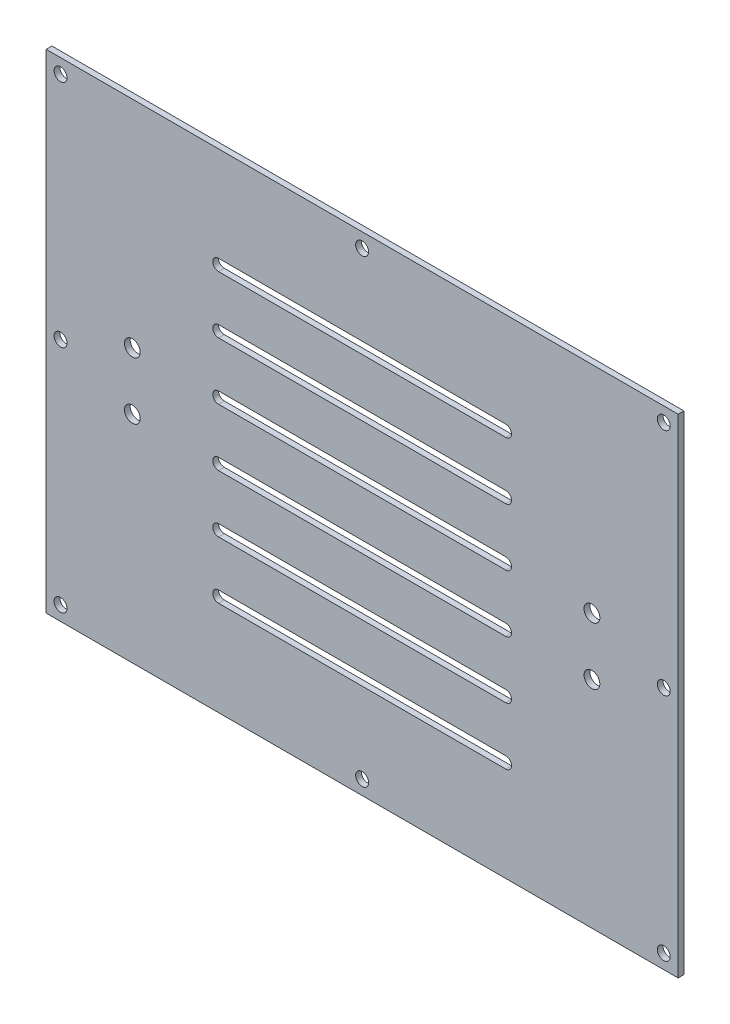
ISO-10303-21;
HEADER;
FILE_DESCRIPTION(('STEP AP214'),'2;1');
FILE_NAME('part.step','',(''),(''),'','','');
FILE_SCHEMA(('AUTOMOTIVE_DESIGN { 1 0 10303 214 1 1 1 1 }'));
ENDSEC;
DATA;
#1=APPLICATION_CONTEXT('core data for automotive mechanical design processes');
#2=APPLICATION_PROTOCOL_DEFINITION('international standard','automotive_design',2000,#1);
#3=PRODUCT_CONTEXT('',#1,'mechanical');
#4=PRODUCT('Part','Part','',(#3));
#5=PRODUCT_RELATED_PRODUCT_CATEGORY('part','',(#4));
#6=PRODUCT_DEFINITION_FORMATION('','',#4);
#7=PRODUCT_DEFINITION_CONTEXT('part definition',#1,'design');
#8=PRODUCT_DEFINITION('design','',#6,#7);
#9=PRODUCT_DEFINITION_SHAPE('','',#8);
#10=(LENGTH_UNIT() NAMED_UNIT(*) SI_UNIT(.MILLI.,.METRE.));
#11=(NAMED_UNIT(*) PLANE_ANGLE_UNIT() SI_UNIT($,.RADIAN.));
#12=(NAMED_UNIT(*) SI_UNIT($,.STERADIAN.) SOLID_ANGLE_UNIT());
#13=UNCERTAINTY_MEASURE_WITH_UNIT(LENGTH_MEASURE(1.E-05),#10,'distance_accuracy_value','');
#14=(GEOMETRIC_REPRESENTATION_CONTEXT(3) GLOBAL_UNCERTAINTY_ASSIGNED_CONTEXT((#13)) GLOBAL_UNIT_ASSIGNED_CONTEXT((#10,
#11,#12)) REPRESENTATION_CONTEXT('',''));
#15=CARTESIAN_POINT('',(0.,0.,0.));
#16=DIRECTION('',(0.,0.,1.));
#17=DIRECTION('',(1.,0.,0.));
#18=AXIS2_PLACEMENT_3D('',#15,#16,#17);
#19=CARTESIAN_POINT('',(0.,0.,2.));
#20=DIRECTION('',(1.,0.,0.));
#21=DIRECTION('',(0.,1.,0.));
#22=AXIS2_PLACEMENT_3D('',#19,#20,#21);
#23=PLANE('',#22);
#24=DIRECTION('',(0.,-1.,0.));
#25=VECTOR('',#24,1.);
#26=CARTESIAN_POINT('',(0.,0.,0.));
#27=LINE('',#26,#25);
#28=CARTESIAN_POINT('',(0.,0.,0.));
#29=VERTEX_POINT('',#28);
#30=CARTESIAN_POINT('',(0.,-170.,0.));
#31=VERTEX_POINT('',#30);
#32=EDGE_CURVE('E333',#29,#31,#27,.T.);
#33=ORIENTED_EDGE('',*,*,#32,.T.);
#34=DIRECTION('',(0.,0.,-1.));
#35=VECTOR('',#34,1.);
#36=CARTESIAN_POINT('',(0.,-170.,2.));
#37=LINE('',#36,#35);
#38=CARTESIAN_POINT('',(0.,-170.,2.));
#39=VERTEX_POINT('',#38);
#40=EDGE_CURVE('E360',#39,#31,#37,.T.);
#41=ORIENTED_EDGE('',*,*,#40,.F.);
#42=DIRECTION('',(0.,-1.,0.));
#43=VECTOR('',#42,1.);
#44=CARTESIAN_POINT('',(0.,0.,2.));
#45=LINE('',#44,#43);
#46=CARTESIAN_POINT('',(0.,0.,2.));
#47=VERTEX_POINT('',#46);
#48=EDGE_CURVE('E334',#47,#39,#45,.T.);
#49=ORIENTED_EDGE('',*,*,#48,.F.);
#50=DIRECTION('',(0.,0.,-1.));
#51=VECTOR('',#50,1.);
#52=CARTESIAN_POINT('',(0.,0.,2.));
#53=LINE('',#52,#51);
#54=EDGE_CURVE('E344',#47,#29,#53,.T.);
#55=ORIENTED_EDGE('',*,*,#54,.T.);
#56=EDGE_LOOP('',(#33,#41,#49,#55));
#57=FACE_BOUND('',#56,.T.);
#58=ADVANCED_FACE('F34',(#57),#23,.F.);
#59=CARTESIAN_POINT('',(0.,-170.,2.));
#60=DIRECTION('',(0.,1.,0.));
#61=DIRECTION('',(0.,0.,1.));
#62=AXIS2_PLACEMENT_3D('',#59,#60,#61);
#63=PLANE('',#62);
#64=DIRECTION('',(1.,0.,0.));
#65=VECTOR('',#64,1.);
#66=CARTESIAN_POINT('',(0.,-170.,0.));
#67=LINE('',#66,#65);
#68=CARTESIAN_POINT('',(220.,-170.,0.));
#69=VERTEX_POINT('',#68);
#70=EDGE_CURVE('E347',#31,#69,#67,.T.);
#71=ORIENTED_EDGE('',*,*,#70,.T.);
#72=DIRECTION('',(0.,0.,-1.));
#73=VECTOR('',#72,1.);
#74=CARTESIAN_POINT('',(220.,-170.,2.));
#75=LINE('',#74,#73);
#76=CARTESIAN_POINT('',(220.,-170.,2.));
#77=VERTEX_POINT('',#76);
#78=EDGE_CURVE('E357',#77,#69,#75,.T.);
#79=ORIENTED_EDGE('',*,*,#78,.F.);
#80=DIRECTION('',(1.,0.,0.));
#81=VECTOR('',#80,1.);
#82=CARTESIAN_POINT('',(0.,-170.,2.));
#83=LINE('',#82,#81);
#84=EDGE_CURVE('E337',#39,#77,#83,.T.);
#85=ORIENTED_EDGE('',*,*,#84,.F.);
#86=ORIENTED_EDGE('',*,*,#40,.T.);
#87=EDGE_LOOP('',(#71,#79,#85,#86));
#88=FACE_BOUND('',#87,.T.);
#89=ADVANCED_FACE('F517',(#88),#63,.F.);
#90=CARTESIAN_POINT('',(220.,0.,2.));
#91=DIRECTION('',(-1.,0.,0.));
#92=DIRECTION('',(0.,-1.,0.));
#93=AXIS2_PLACEMENT_3D('',#90,#91,#92);
#94=PLANE('',#93);
#95=DIRECTION('',(0.,1.,0.));
#96=VECTOR('',#95,1.);
#97=CARTESIAN_POINT('',(220.,0.,0.));
#98=LINE('',#97,#96);
#99=CARTESIAN_POINT('',(220.,0.,0.));
#100=VERTEX_POINT('',#99);
#101=EDGE_CURVE('E349',#69,#100,#98,.T.);
#102=ORIENTED_EDGE('',*,*,#101,.T.);
#103=DIRECTION('',(0.,0.,-1.));
#104=VECTOR('',#103,1.);
#105=CARTESIAN_POINT('',(220.,0.,2.));
#106=LINE('',#105,#104);
#107=CARTESIAN_POINT('',(220.,0.,2.));
#108=VERTEX_POINT('',#107);
#109=EDGE_CURVE('E354',#108,#100,#106,.T.);
#110=ORIENTED_EDGE('',*,*,#109,.F.);
#111=DIRECTION('',(0.,1.,0.));
#112=VECTOR('',#111,1.);
#113=CARTESIAN_POINT('',(220.,0.,2.));
#114=LINE('',#113,#112);
#115=EDGE_CURVE('E340',#77,#108,#114,.T.);
#116=ORIENTED_EDGE('',*,*,#115,.F.);
#117=ORIENTED_EDGE('',*,*,#78,.T.);
#118=EDGE_LOOP('',(#102,#110,#116,#117));
#119=FACE_BOUND('',#118,.T.);
#120=ADVANCED_FACE('F510',(#119),#94,.F.);
#121=CARTESIAN_POINT('',(0.,0.,2.));
#122=DIRECTION('',(0.,-1.,0.));
#123=DIRECTION('',(0.,0.,-1.));
#124=AXIS2_PLACEMENT_3D('',#121,#122,#123);
#125=PLANE('',#124);
#126=DIRECTION('',(-1.,0.,0.));
#127=VECTOR('',#126,1.);
#128=CARTESIAN_POINT('',(0.,0.,0.));
#129=LINE('',#128,#127);
#130=EDGE_CURVE('E338',#100,#29,#129,.T.);
#131=ORIENTED_EDGE('',*,*,#130,.T.);
#132=ORIENTED_EDGE('',*,*,#54,.F.);
#133=DIRECTION('',(-1.,0.,0.));
#134=VECTOR('',#133,1.);
#135=CARTESIAN_POINT('',(0.,0.,2.));
#136=LINE('',#135,#134);
#137=EDGE_CURVE('E342',#108,#47,#136,.T.);
#138=ORIENTED_EDGE('',*,*,#137,.F.);
#139=ORIENTED_EDGE('',*,*,#109,.T.);
#140=EDGE_LOOP('',(#131,#132,#138,#139));
#141=FACE_BOUND('',#140,.T.);
#142=ADVANCED_FACE('F499',(#141),#125,.F.);
#143=CARTESIAN_POINT('',(0.,-170.,2.));
#144=DIRECTION('',(0.,0.,1.));
#145=DIRECTION('',(1.,0.,0.));
#146=AXIS2_PLACEMENT_3D('',#143,#144,#145);
#147=PLANE('',#146);
#148=CARTESIAN_POINT('',(190.,-95.,2.));
#149=DIRECTION('',(0.,0.,1.));
#150=DIRECTION('',(1.,0.,0.));
#151=AXIS2_PLACEMENT_3D('',#148,#149,#150);
#152=CIRCLE('',#151,2.75000000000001);
#153=CARTESIAN_POINT('',(192.75,-95.,2.));
#154=VERTEX_POINT('',#153);
#155=EDGE_CURVE('E871',#154,#154,#152,.T.);
#156=ORIENTED_EDGE('',*,*,#155,.F.);
#157=EDGE_LOOP('',(#156));
#158=FACE_BOUND('',#157,.T.);
#159=CARTESIAN_POINT('',(190.,-75.,2.));
#160=DIRECTION('',(0.,0.,1.));
#161=DIRECTION('',(1.,0.,0.));
#162=AXIS2_PLACEMENT_3D('',#159,#160,#161);
#163=CIRCLE('',#162,2.75000000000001);
#164=CARTESIAN_POINT('',(192.75,-75.,2.));
#165=VERTEX_POINT('',#164);
#166=EDGE_CURVE('E875',#165,#165,#163,.T.);
#167=ORIENTED_EDGE('',*,*,#166,.F.);
#168=EDGE_LOOP('',(#167));
#169=FACE_BOUND('',#168,.T.);
#170=CARTESIAN_POINT('',(30.,-95.,2.));
#171=DIRECTION('',(0.,0.,1.));
#172=DIRECTION('',(1.,0.,0.));
#173=AXIS2_PLACEMENT_3D('',#170,#171,#172);
#174=CIRCLE('',#173,2.75);
#175=CARTESIAN_POINT('',(32.75,-95.,2.));
#176=VERTEX_POINT('',#175);
#177=EDGE_CURVE('E884',#176,#176,#174,.T.);
#178=ORIENTED_EDGE('',*,*,#177,.F.);
#179=EDGE_LOOP('',(#178));
#180=FACE_BOUND('',#179,.T.);
#181=CARTESIAN_POINT('',(30.,-75.,2.));
#182=DIRECTION('',(0.,0.,1.));
#183=DIRECTION('',(1.,0.,0.));
#184=AXIS2_PLACEMENT_3D('',#181,#182,#183);
#185=CIRCLE('',#184,2.75);
#186=CARTESIAN_POINT('',(32.75,-75.,2.));
#187=VERTEX_POINT('',#186);
#188=EDGE_CURVE('E890',#187,#187,#185,.T.);
#189=ORIENTED_EDGE('',*,*,#188,.F.);
#190=EDGE_LOOP('',(#189));
#191=FACE_BOUND('',#190,.T.);
#192=CARTESIAN_POINT('',(60.,-55.,2.));
#193=DIRECTION('',(0.,0.,1.));
#194=DIRECTION('',(1.,0.,0.));
#195=AXIS2_PLACEMENT_3D('',#192,#193,#194);
#196=CIRCLE('',#195,2.00000000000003);
#197=CARTESIAN_POINT('',(60.,-53.,2.));
#198=VERTEX_POINT('',#197);
#199=CARTESIAN_POINT('',(60.,-57.,2.));
#200=VERTEX_POINT('',#199);
#201=EDGE_CURVE('E241',#198,#200,#196,.T.);
#202=ORIENTED_EDGE('',*,*,#201,.F.);
#203=DIRECTION('',(-1.,0.,0.));
#204=VECTOR('',#203,1.);
#205=CARTESIAN_POINT('',(60.,-53.,2.));
#206=LINE('',#205,#204);
#207=CARTESIAN_POINT('',(160.,-53.,2.));
#208=VERTEX_POINT('',#207);
#209=EDGE_CURVE('E251',#208,#198,#206,.T.);
#210=ORIENTED_EDGE('',*,*,#209,.F.);
#211=CARTESIAN_POINT('',(160.,-55.,2.));
#212=DIRECTION('',(0.,0.,1.));
#213=DIRECTION('',(1.,0.,0.));
#214=AXIS2_PLACEMENT_3D('',#211,#212,#213);
#215=CIRCLE('',#214,2.00000000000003);
#216=CARTESIAN_POINT('',(160.,-57.,2.));
#217=VERTEX_POINT('',#216);
#218=EDGE_CURVE('E899',#217,#208,#215,.T.);
#219=ORIENTED_EDGE('',*,*,#218,.F.);
#220=DIRECTION('',(1.,0.,0.));
#221=VECTOR('',#220,1.);
#222=CARTESIAN_POINT('',(60.,-57.,2.));
#223=LINE('',#222,#221);
#224=EDGE_CURVE('E231',#200,#217,#223,.T.);
#225=ORIENTED_EDGE('',*,*,#224,.F.);
#226=EDGE_LOOP('',(#202,#210,#219,#225));
#227=FACE_BOUND('',#226,.T.);
#228=CARTESIAN_POINT('',(110.,-165.,2.));
#229=DIRECTION('',(0.,0.,1.));
#230=DIRECTION('',(1.,0.,0.));
#231=AXIS2_PLACEMENT_3D('',#228,#229,#230);
#232=CIRCLE('',#231,2.25);
#233=CARTESIAN_POINT('',(112.25,-165.,2.));
#234=VERTEX_POINT('',#233);
#235=EDGE_CURVE('E249',#234,#234,#232,.T.);
#236=ORIENTED_EDGE('',*,*,#235,.F.);
#237=EDGE_LOOP('',(#236));
#238=FACE_BOUND('',#237,.T.);
#239=CARTESIAN_POINT('',(110.,-5.,2.));
#240=DIRECTION('',(0.,0.,1.));
#241=DIRECTION('',(1.,0.,0.));
#242=AXIS2_PLACEMENT_3D('',#239,#240,#241);
#243=CIRCLE('',#242,2.25);
#244=CARTESIAN_POINT('',(112.25,-5.,2.));
#245=VERTEX_POINT('',#244);
#246=EDGE_CURVE('E258',#245,#245,#243,.T.);
#247=ORIENTED_EDGE('',*,*,#246,.F.);
#248=EDGE_LOOP('',(#247));
#249=FACE_BOUND('',#248,.T.);
#250=CARTESIAN_POINT('',(215.,-85.,2.));
#251=DIRECTION('',(0.,0.,1.));
#252=DIRECTION('',(1.,0.,0.));
#253=AXIS2_PLACEMENT_3D('',#250,#251,#252);
#254=CIRCLE('',#253,2.25000000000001);
#255=CARTESIAN_POINT('',(217.25,-85.,2.));
#256=VERTEX_POINT('',#255);
#257=EDGE_CURVE('E264',#256,#256,#254,.T.);
#258=ORIENTED_EDGE('',*,*,#257,.F.);
#259=EDGE_LOOP('',(#258));
#260=FACE_BOUND('',#259,.T.);
#261=CARTESIAN_POINT('',(5.,-85.,2.));
#262=DIRECTION('',(0.,0.,1.));
#263=DIRECTION('',(1.,0.,0.));
#264=AXIS2_PLACEMENT_3D('',#261,#262,#263);
#265=CIRCLE('',#264,2.25);
#266=CARTESIAN_POINT('',(7.25,-85.,2.));
#267=VERTEX_POINT('',#266);
#268=EDGE_CURVE('E270',#267,#267,#265,.T.);
#269=ORIENTED_EDGE('',*,*,#268,.F.);
#270=EDGE_LOOP('',(#269));
#271=FACE_BOUND('',#270,.T.);
#272=CARTESIAN_POINT('',(215.,-165.,2.));
#273=DIRECTION('',(0.,0.,1.));
#274=DIRECTION('',(1.,0.,0.));
#275=AXIS2_PLACEMENT_3D('',#272,#273,#274);
#276=CIRCLE('',#275,2.25000000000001);
#277=CARTESIAN_POINT('',(217.25,-165.,2.));
#278=VERTEX_POINT('',#277);
#279=EDGE_CURVE('E276',#278,#278,#276,.T.);
#280=ORIENTED_EDGE('',*,*,#279,.F.);
#281=EDGE_LOOP('',(#280));
#282=FACE_BOUND('',#281,.T.);
#283=CARTESIAN_POINT('',(5.,-165.,2.));
#284=DIRECTION('',(0.,0.,1.));
#285=DIRECTION('',(1.,0.,0.));
#286=AXIS2_PLACEMENT_3D('',#283,#284,#285);
#287=CIRCLE('',#286,2.25);
#288=CARTESIAN_POINT('',(7.25,-165.,2.));
#289=VERTEX_POINT('',#288);
#290=EDGE_CURVE('E282',#289,#289,#287,.T.);
#291=ORIENTED_EDGE('',*,*,#290,.F.);
#292=EDGE_LOOP('',(#291));
#293=FACE_BOUND('',#292,.T.);
#294=CARTESIAN_POINT('',(215.,-5.,2.));
#295=DIRECTION('',(0.,0.,1.));
#296=DIRECTION('',(1.,0.,0.));
#297=AXIS2_PLACEMENT_3D('',#294,#295,#296);
#298=CIRCLE('',#297,2.25000000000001);
#299=CARTESIAN_POINT('',(217.25,-5.,2.));
#300=VERTEX_POINT('',#299);
#301=EDGE_CURVE('E288',#300,#300,#298,.T.);
#302=ORIENTED_EDGE('',*,*,#301,.F.);
#303=EDGE_LOOP('',(#302));
#304=FACE_BOUND('',#303,.T.);
#305=CARTESIAN_POINT('',(5.,-5.,2.));
#306=DIRECTION('',(0.,0.,1.));
#307=DIRECTION('',(1.,0.,0.));
#308=AXIS2_PLACEMENT_3D('',#305,#306,#307);
#309=CIRCLE('',#308,2.25);
#310=CARTESIAN_POINT('',(7.25,-5.,2.));
#311=VERTEX_POINT('',#310);
#312=EDGE_CURVE('E294',#311,#311,#309,.T.);
#313=ORIENTED_EDGE('',*,*,#312,.F.);
#314=EDGE_LOOP('',(#313));
#315=FACE_BOUND('',#314,.T.);
#316=CARTESIAN_POINT('',(60.,-35.,2.));
#317=DIRECTION('',(0.,0.,1.));
#318=DIRECTION('',(1.,0.,0.));
#319=AXIS2_PLACEMENT_3D('',#316,#317,#318);
#320=CIRCLE('',#319,2.00000000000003);
#321=CARTESIAN_POINT('',(60.,-33.,2.));
#322=VERTEX_POINT('',#321);
#323=CARTESIAN_POINT('',(60.,-37.,2.));
#324=VERTEX_POINT('',#323);
#325=EDGE_CURVE('E310',#322,#324,#320,.T.);
#326=ORIENTED_EDGE('',*,*,#325,.F.);
#327=DIRECTION('',(-1.,0.,0.));
#328=VECTOR('',#327,1.);
#329=CARTESIAN_POINT('',(60.,-33.,2.));
#330=LINE('',#329,#328);
#331=CARTESIAN_POINT('',(160.,-33.,2.));
#332=VERTEX_POINT('',#331);
#333=EDGE_CURVE('E318',#332,#322,#330,.T.);
#334=ORIENTED_EDGE('',*,*,#333,.F.);
#335=CARTESIAN_POINT('',(160.,-35.,2.));
#336=DIRECTION('',(0.,0.,1.));
#337=DIRECTION('',(1.,0.,0.));
#338=AXIS2_PLACEMENT_3D('',#335,#336,#337);
#339=CIRCLE('',#338,2.00000000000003);
#340=CARTESIAN_POINT('',(160.,-37.,2.));
#341=VERTEX_POINT('',#340);
#342=EDGE_CURVE('E315',#341,#332,#339,.T.);
#343=ORIENTED_EDGE('',*,*,#342,.F.);
#344=DIRECTION('',(1.,0.,0.));
#345=VECTOR('',#344,1.);
#346=CARTESIAN_POINT('',(60.,-37.,2.));
#347=LINE('',#346,#345);
#348=EDGE_CURVE('E312',#324,#341,#347,.T.);
#349=ORIENTED_EDGE('',*,*,#348,.F.);
#350=EDGE_LOOP('',(#326,#334,#343,#349));
#351=FACE_BOUND('',#350,.T.);
#352=ORIENTED_EDGE('',*,*,#48,.T.);
#353=ORIENTED_EDGE('',*,*,#84,.T.);
#354=ORIENTED_EDGE('',*,*,#115,.T.);
#355=ORIENTED_EDGE('',*,*,#137,.T.);
#356=EDGE_LOOP('',(#352,#353,#354,#355));
#357=FACE_BOUND('',#356,.T.);
#358=CARTESIAN_POINT('',(60.,-75.,2.));
#359=DIRECTION('',(0.,0.,1.));
#360=DIRECTION('',(1.,0.,0.));
#361=AXIS2_PLACEMENT_3D('',#358,#359,#360);
#362=CIRCLE('',#361,2.00000000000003);
#363=CARTESIAN_POINT('',(60.,-73.,2.));
#364=VERTEX_POINT('',#363);
#365=CARTESIAN_POINT('',(60.,-77.,2.));
#366=VERTEX_POINT('',#365);
#367=EDGE_CURVE('E374',#364,#366,#362,.T.);
#368=ORIENTED_EDGE('',*,*,#367,.F.);
#369=DIRECTION('',(-1.,0.,0.));
#370=VECTOR('',#369,1.);
#371=CARTESIAN_POINT('',(60.,-73.,2.));
#372=LINE('',#371,#370);
#373=CARTESIAN_POINT('',(160.,-73.,2.));
#374=VERTEX_POINT('',#373);
#375=EDGE_CURVE('E376',#374,#364,#372,.T.);
#376=ORIENTED_EDGE('',*,*,#375,.F.);
#377=CARTESIAN_POINT('',(160.,-75.,2.));
#378=DIRECTION('',(0.,0.,1.));
#379=DIRECTION('',(1.,0.,0.));
#380=AXIS2_PLACEMENT_3D('',#377,#378,#379);
#381=CIRCLE('',#380,2.00000000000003);
#382=CARTESIAN_POINT('',(160.,-77.,2.));
#383=VERTEX_POINT('',#382);
#384=EDGE_CURVE('E379',#383,#374,#381,.T.);
#385=ORIENTED_EDGE('',*,*,#384,.F.);
#386=DIRECTION('',(1.,0.,0.));
#387=VECTOR('',#386,1.);
#388=CARTESIAN_POINT('',(60.,-77.,2.));
#389=LINE('',#388,#387);
#390=EDGE_CURVE('E382',#366,#383,#389,.T.);
#391=ORIENTED_EDGE('',*,*,#390,.F.);
#392=EDGE_LOOP('',(#368,#376,#385,#391));
#393=FACE_BOUND('',#392,.T.);
#394=CARTESIAN_POINT('',(60.,-95.,2.));
#395=DIRECTION('',(0.,0.,1.));
#396=DIRECTION('',(1.,0.,0.));
#397=AXIS2_PLACEMENT_3D('',#394,#395,#396);
#398=CIRCLE('',#397,2.00000000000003);
#399=CARTESIAN_POINT('',(60.,-93.,2.));
#400=VERTEX_POINT('',#399);
#401=CARTESIAN_POINT('',(60.,-97.,2.));
#402=VERTEX_POINT('',#401);
#403=EDGE_CURVE('E408',#400,#402,#398,.T.);
#404=ORIENTED_EDGE('',*,*,#403,.F.);
#405=DIRECTION('',(-1.,0.,0.));
#406=VECTOR('',#405,1.);
#407=CARTESIAN_POINT('',(60.,-93.,2.));
#408=LINE('',#407,#406);
#409=CARTESIAN_POINT('',(160.,-92.9999999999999,2.));
#410=VERTEX_POINT('',#409);
#411=EDGE_CURVE('E410',#410,#400,#408,.T.);
#412=ORIENTED_EDGE('',*,*,#411,.F.);
#413=CARTESIAN_POINT('',(160.,-95.,2.));
#414=DIRECTION('',(0.,0.,1.));
#415=DIRECTION('',(1.,0.,0.));
#416=AXIS2_PLACEMENT_3D('',#413,#414,#415);
#417=CIRCLE('',#416,2.00000000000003);
#418=CARTESIAN_POINT('',(160.,-97.,2.));
#419=VERTEX_POINT('',#418);
#420=EDGE_CURVE('E413',#419,#410,#417,.T.);
#421=ORIENTED_EDGE('',*,*,#420,.F.);
#422=DIRECTION('',(1.,0.,0.));
#423=VECTOR('',#422,1.);
#424=CARTESIAN_POINT('',(60.,-97.,2.));
#425=LINE('',#424,#423);
#426=EDGE_CURVE('E416',#402,#419,#425,.T.);
#427=ORIENTED_EDGE('',*,*,#426,.F.);
#428=EDGE_LOOP('',(#404,#412,#421,#427));
#429=FACE_BOUND('',#428,.T.);
#430=CARTESIAN_POINT('',(60.,-115.,2.));
#431=DIRECTION('',(0.,0.,1.));
#432=DIRECTION('',(1.,0.,0.));
#433=AXIS2_PLACEMENT_3D('',#430,#431,#432);
#434=CIRCLE('',#433,2.00000000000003);
#435=CARTESIAN_POINT('',(60.,-113.,2.));
#436=VERTEX_POINT('',#435);
#437=CARTESIAN_POINT('',(60.,-117.,2.));
#438=VERTEX_POINT('',#437);
#439=EDGE_CURVE('E442',#436,#438,#434,.T.);
#440=ORIENTED_EDGE('',*,*,#439,.F.);
#441=DIRECTION('',(-1.,0.,0.));
#442=VECTOR('',#441,1.);
#443=CARTESIAN_POINT('',(60.,-113.,2.));
#444=LINE('',#443,#442);
#445=CARTESIAN_POINT('',(160.,-113.,2.));
#446=VERTEX_POINT('',#445);
#447=EDGE_CURVE('E444',#446,#436,#444,.T.);
#448=ORIENTED_EDGE('',*,*,#447,.F.);
#449=CARTESIAN_POINT('',(160.,-115.,2.));
#450=DIRECTION('',(0.,0.,1.));
#451=DIRECTION('',(1.,0.,0.));
#452=AXIS2_PLACEMENT_3D('',#449,#450,#451);
#453=CIRCLE('',#452,2.00000000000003);
#454=CARTESIAN_POINT('',(160.,-117.,2.));
#455=VERTEX_POINT('',#454);
#456=EDGE_CURVE('E447',#455,#446,#453,.T.);
#457=ORIENTED_EDGE('',*,*,#456,.F.);
#458=DIRECTION('',(1.,0.,0.));
#459=VECTOR('',#458,1.);
#460=CARTESIAN_POINT('',(60.,-117.,2.));
#461=LINE('',#460,#459);
#462=EDGE_CURVE('E450',#438,#455,#461,.T.);
#463=ORIENTED_EDGE('',*,*,#462,.F.);
#464=EDGE_LOOP('',(#440,#448,#457,#463));
#465=FACE_BOUND('',#464,.T.);
#466=CARTESIAN_POINT('',(60.,-135.,2.));
#467=DIRECTION('',(0.,0.,1.));
#468=DIRECTION('',(1.,0.,0.));
#469=AXIS2_PLACEMENT_3D('',#466,#467,#468);
#470=CIRCLE('',#469,2.00000000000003);
#471=CARTESIAN_POINT('',(60.,-133.,2.));
#472=VERTEX_POINT('',#471);
#473=CARTESIAN_POINT('',(60.,-137.,2.));
#474=VERTEX_POINT('',#473);
#475=EDGE_CURVE('E49',#472,#474,#470,.T.);
#476=ORIENTED_EDGE('',*,*,#475,.F.);
#477=DIRECTION('',(-1.,0.,0.));
#478=VECTOR('',#477,1.);
#479=CARTESIAN_POINT('',(60.,-133.,2.));
#480=LINE('',#479,#478);
#481=CARTESIAN_POINT('',(160.,-133.,2.));
#482=VERTEX_POINT('',#481);
#483=EDGE_CURVE('E477',#482,#472,#480,.T.);
#484=ORIENTED_EDGE('',*,*,#483,.F.);
#485=CARTESIAN_POINT('',(160.,-135.,2.));
#486=DIRECTION('',(0.,0.,1.));
#487=DIRECTION('',(1.,0.,0.));
#488=AXIS2_PLACEMENT_3D('',#485,#486,#487);
#489=CIRCLE('',#488,2.00000000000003);
#490=CARTESIAN_POINT('',(160.,-137.,2.));
#491=VERTEX_POINT('',#490);
#492=EDGE_CURVE('E56',#491,#482,#489,.T.);
#493=ORIENTED_EDGE('',*,*,#492,.F.);
#494=DIRECTION('',(1.,0.,0.));
#495=VECTOR('',#494,1.);
#496=CARTESIAN_POINT('',(60.,-137.,2.));
#497=LINE('',#496,#495);
#498=EDGE_CURVE('E481',#474,#491,#497,.T.);
#499=ORIENTED_EDGE('',*,*,#498,.F.);
#500=EDGE_LOOP('',(#476,#484,#493,#499));
#501=FACE_BOUND('',#500,.T.);
#502=ADVANCED_FACE('F497',(#158,#169,#180,#191,#227,#238,#249,#260,#271,#282,#293,#304,#315,
#351,#357,#393,#429,#465,#501),#147,.T.);
#503=CARTESIAN_POINT('',(0.,-170.,0.));
#504=DIRECTION('',(0.,0.,1.));
#505=DIRECTION('',(1.,0.,0.));
#506=AXIS2_PLACEMENT_3D('',#503,#504,#505);
#507=PLANE('',#506);
#508=CARTESIAN_POINT('',(190.,-95.,0.));
#509=DIRECTION('',(0.,0.,1.));
#510=DIRECTION('',(1.,0.,0.));
#511=AXIS2_PLACEMENT_3D('',#508,#509,#510);
#512=CIRCLE('',#511,2.75000000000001);
#513=CARTESIAN_POINT('',(192.75,-95.,0.));
#514=VERTEX_POINT('',#513);
#515=EDGE_CURVE('E874',#514,#514,#512,.F.);
#516=ORIENTED_EDGE('',*,*,#515,.F.);
#517=EDGE_LOOP('',(#516));
#518=FACE_BOUND('',#517,.T.);
#519=CARTESIAN_POINT('',(190.,-75.,0.));
#520=DIRECTION('',(0.,0.,1.));
#521=DIRECTION('',(1.,0.,0.));
#522=AXIS2_PLACEMENT_3D('',#519,#520,#521);
#523=CIRCLE('',#522,2.75000000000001);
#524=CARTESIAN_POINT('',(192.75,-75.,0.));
#525=VERTEX_POINT('',#524);
#526=EDGE_CURVE('E878',#525,#525,#523,.F.);
#527=ORIENTED_EDGE('',*,*,#526,.F.);
#528=EDGE_LOOP('',(#527));
#529=FACE_BOUND('',#528,.T.);
#530=CARTESIAN_POINT('',(30.,-95.,0.));
#531=DIRECTION('',(0.,0.,1.));
#532=DIRECTION('',(1.,0.,0.));
#533=AXIS2_PLACEMENT_3D('',#530,#531,#532);
#534=CIRCLE('',#533,2.75);
#535=CARTESIAN_POINT('',(32.75,-95.,0.));
#536=VERTEX_POINT('',#535);
#537=EDGE_CURVE('E887',#536,#536,#534,.F.);
#538=ORIENTED_EDGE('',*,*,#537,.F.);
#539=EDGE_LOOP('',(#538));
#540=FACE_BOUND('',#539,.T.);
#541=CARTESIAN_POINT('',(30.,-75.,0.));
#542=DIRECTION('',(0.,0.,1.));
#543=DIRECTION('',(1.,0.,0.));
#544=AXIS2_PLACEMENT_3D('',#541,#542,#543);
#545=CIRCLE('',#544,2.75);
#546=CARTESIAN_POINT('',(32.75,-75.,0.));
#547=VERTEX_POINT('',#546);
#548=EDGE_CURVE('E232',#547,#547,#545,.F.);
#549=ORIENTED_EDGE('',*,*,#548,.F.);
#550=EDGE_LOOP('',(#549));
#551=FACE_BOUND('',#550,.T.);
#552=DIRECTION('',(1.,0.,0.));
#553=VECTOR('',#552,1.);
#554=CARTESIAN_POINT('',(60.,-53.,0.));
#555=LINE('',#554,#553);
#556=CARTESIAN_POINT('',(60.,-53.,0.));
#557=VERTEX_POINT('',#556);
#558=CARTESIAN_POINT('',(160.,-53.,0.));
#559=VERTEX_POINT('',#558);
#560=EDGE_CURVE('E246',#557,#559,#555,.T.);
#561=ORIENTED_EDGE('',*,*,#560,.F.);
#562=CARTESIAN_POINT('',(60.,-55.,0.));
#563=DIRECTION('',(0.,0.,1.));
#564=DIRECTION('',(1.,0.,0.));
#565=AXIS2_PLACEMENT_3D('',#562,#563,#564);
#566=CIRCLE('',#565,2.00000000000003);
#567=CARTESIAN_POINT('',(60.,-57.,0.));
#568=VERTEX_POINT('',#567);
#569=EDGE_CURVE('E238',#568,#557,#566,.F.);
#570=ORIENTED_EDGE('',*,*,#569,.F.);
#571=DIRECTION('',(-1.,0.,0.));
#572=VECTOR('',#571,1.);
#573=CARTESIAN_POINT('',(60.,-57.,0.));
#574=LINE('',#573,#572);
#575=CARTESIAN_POINT('',(160.,-57.,0.));
#576=VERTEX_POINT('',#575);
#577=EDGE_CURVE('E221',#576,#568,#574,.T.);
#578=ORIENTED_EDGE('',*,*,#577,.F.);
#579=CARTESIAN_POINT('',(160.,-55.,0.));
#580=DIRECTION('',(0.,0.,1.));
#581=DIRECTION('',(1.,0.,0.));
#582=AXIS2_PLACEMENT_3D('',#579,#580,#581);
#583=CIRCLE('',#582,2.00000000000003);
#584=EDGE_CURVE('E897',#559,#576,#583,.F.);
#585=ORIENTED_EDGE('',*,*,#584,.F.);
#586=EDGE_LOOP('',(#561,#570,#578,#585));
#587=FACE_BOUND('',#586,.T.);
#588=CARTESIAN_POINT('',(110.,-165.,0.));
#589=DIRECTION('',(0.,0.,1.));
#590=DIRECTION('',(1.,0.,0.));
#591=AXIS2_PLACEMENT_3D('',#588,#589,#590);
#592=CIRCLE('',#591,2.25);
#593=CARTESIAN_POINT('',(112.25,-165.,0.));
#594=VERTEX_POINT('',#593);
#595=EDGE_CURVE('E255',#594,#594,#592,.T.);
#596=ORIENTED_EDGE('',*,*,#595,.T.);
#597=EDGE_LOOP('',(#596));
#598=FACE_BOUND('',#597,.T.);
#599=CARTESIAN_POINT('',(110.,-5.,0.));
#600=DIRECTION('',(0.,0.,1.));
#601=DIRECTION('',(1.,0.,0.));
#602=AXIS2_PLACEMENT_3D('',#599,#600,#601);
#603=CIRCLE('',#602,2.25);
#604=CARTESIAN_POINT('',(112.25,-5.,0.));
#605=VERTEX_POINT('',#604);
#606=EDGE_CURVE('E261',#605,#605,#603,.T.);
#607=ORIENTED_EDGE('',*,*,#606,.T.);
#608=EDGE_LOOP('',(#607));
#609=FACE_BOUND('',#608,.T.);
#610=CARTESIAN_POINT('',(215.,-85.,0.));
#611=DIRECTION('',(0.,0.,1.));
#612=DIRECTION('',(1.,0.,0.));
#613=AXIS2_PLACEMENT_3D('',#610,#611,#612);
#614=CIRCLE('',#613,2.25000000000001);
#615=CARTESIAN_POINT('',(217.25,-85.,0.));
#616=VERTEX_POINT('',#615);
#617=EDGE_CURVE('E267',#616,#616,#614,.T.);
#618=ORIENTED_EDGE('',*,*,#617,.T.);
#619=EDGE_LOOP('',(#618));
#620=FACE_BOUND('',#619,.T.);
#621=CARTESIAN_POINT('',(5.,-85.,0.));
#622=DIRECTION('',(0.,0.,1.));
#623=DIRECTION('',(1.,0.,0.));
#624=AXIS2_PLACEMENT_3D('',#621,#622,#623);
#625=CIRCLE('',#624,2.25);
#626=CARTESIAN_POINT('',(7.25,-85.,0.));
#627=VERTEX_POINT('',#626);
#628=EDGE_CURVE('E273',#627,#627,#625,.T.);
#629=ORIENTED_EDGE('',*,*,#628,.T.);
#630=EDGE_LOOP('',(#629));
#631=FACE_BOUND('',#630,.T.);
#632=CARTESIAN_POINT('',(215.,-165.,0.));
#633=DIRECTION('',(0.,0.,1.));
#634=DIRECTION('',(1.,0.,0.));
#635=AXIS2_PLACEMENT_3D('',#632,#633,#634);
#636=CIRCLE('',#635,2.25000000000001);
#637=CARTESIAN_POINT('',(217.25,-165.,0.));
#638=VERTEX_POINT('',#637);
#639=EDGE_CURVE('E279',#638,#638,#636,.T.);
#640=ORIENTED_EDGE('',*,*,#639,.T.);
#641=EDGE_LOOP('',(#640));
#642=FACE_BOUND('',#641,.T.);
#643=CARTESIAN_POINT('',(5.,-165.,0.));
#644=DIRECTION('',(0.,0.,1.));
#645=DIRECTION('',(1.,0.,0.));
#646=AXIS2_PLACEMENT_3D('',#643,#644,#645);
#647=CIRCLE('',#646,2.25);
#648=CARTESIAN_POINT('',(7.25,-165.,0.));
#649=VERTEX_POINT('',#648);
#650=EDGE_CURVE('E285',#649,#649,#647,.T.);
#651=ORIENTED_EDGE('',*,*,#650,.T.);
#652=EDGE_LOOP('',(#651));
#653=FACE_BOUND('',#652,.T.);
#654=CARTESIAN_POINT('',(215.,-5.,0.));
#655=DIRECTION('',(0.,0.,1.));
#656=DIRECTION('',(1.,0.,0.));
#657=AXIS2_PLACEMENT_3D('',#654,#655,#656);
#658=CIRCLE('',#657,2.25000000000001);
#659=CARTESIAN_POINT('',(217.25,-5.,0.));
#660=VERTEX_POINT('',#659);
#661=EDGE_CURVE('E291',#660,#660,#658,.T.);
#662=ORIENTED_EDGE('',*,*,#661,.T.);
#663=EDGE_LOOP('',(#662));
#664=FACE_BOUND('',#663,.T.);
#665=CARTESIAN_POINT('',(5.,-5.,0.));
#666=DIRECTION('',(0.,0.,1.));
#667=DIRECTION('',(1.,0.,0.));
#668=AXIS2_PLACEMENT_3D('',#665,#666,#667);
#669=CIRCLE('',#668,2.25);
#670=CARTESIAN_POINT('',(7.25,-5.,0.));
#671=VERTEX_POINT('',#670);
#672=EDGE_CURVE('E297',#671,#671,#669,.T.);
#673=ORIENTED_EDGE('',*,*,#672,.T.);
#674=EDGE_LOOP('',(#673));
#675=FACE_BOUND('',#674,.T.);
#676=DIRECTION('',(1.,0.,0.));
#677=VECTOR('',#676,1.);
#678=CARTESIAN_POINT('',(60.,-33.,0.));
#679=LINE('',#678,#677);
#680=CARTESIAN_POINT('',(60.,-33.,0.));
#681=VERTEX_POINT('',#680);
#682=CARTESIAN_POINT('',(160.,-33.,0.));
#683=VERTEX_POINT('',#682);
#684=EDGE_CURVE('E304',#681,#683,#679,.T.);
#685=ORIENTED_EDGE('',*,*,#684,.F.);
#686=CARTESIAN_POINT('',(60.,-35.,0.));
#687=DIRECTION('',(0.,0.,1.));
#688=DIRECTION('',(1.,0.,0.));
#689=AXIS2_PLACEMENT_3D('',#686,#687,#688);
#690=CIRCLE('',#689,2.00000000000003);
#691=CARTESIAN_POINT('',(60.,-37.,0.));
#692=VERTEX_POINT('',#691);
#693=EDGE_CURVE('E307',#692,#681,#690,.F.);
#694=ORIENTED_EDGE('',*,*,#693,.F.);
#695=DIRECTION('',(-1.,0.,0.));
#696=VECTOR('',#695,1.);
#697=CARTESIAN_POINT('',(60.,-37.,0.));
#698=LINE('',#697,#696);
#699=CARTESIAN_POINT('',(160.,-37.,0.));
#700=VERTEX_POINT('',#699);
#701=EDGE_CURVE('E324',#700,#692,#698,.T.);
#702=ORIENTED_EDGE('',*,*,#701,.F.);
#703=CARTESIAN_POINT('',(160.,-35.,0.));
#704=DIRECTION('',(0.,0.,1.));
#705=DIRECTION('',(1.,0.,0.));
#706=AXIS2_PLACEMENT_3D('',#703,#704,#705);
#707=CIRCLE('',#706,2.00000000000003);
#708=EDGE_CURVE('E300',#683,#700,#707,.F.);
#709=ORIENTED_EDGE('',*,*,#708,.F.);
#710=EDGE_LOOP('',(#685,#694,#702,#709));
#711=FACE_BOUND('',#710,.T.);
#712=ORIENTED_EDGE('',*,*,#32,.F.);
#713=ORIENTED_EDGE('',*,*,#130,.F.);
#714=ORIENTED_EDGE('',*,*,#101,.F.);
#715=ORIENTED_EDGE('',*,*,#70,.F.);
#716=EDGE_LOOP('',(#712,#713,#714,#715));
#717=FACE_BOUND('',#716,.T.);
#718=CARTESIAN_POINT('',(60.,-75.,0.));
#719=DIRECTION('',(0.,0.,1.));
#720=DIRECTION('',(1.,0.,0.));
#721=AXIS2_PLACEMENT_3D('',#718,#719,#720);
#722=CIRCLE('',#721,2.00000000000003);
#723=CARTESIAN_POINT('',(60.,-77.,0.));
#724=VERTEX_POINT('',#723);
#725=CARTESIAN_POINT('',(60.,-73.,0.));
#726=VERTEX_POINT('',#725);
#727=EDGE_CURVE('E363',#724,#726,#722,.F.);
#728=ORIENTED_EDGE('',*,*,#727,.F.);
#729=DIRECTION('',(-1.,0.,0.));
#730=VECTOR('',#729,1.);
#731=CARTESIAN_POINT('',(60.,-77.,0.));
#732=LINE('',#731,#730);
#733=CARTESIAN_POINT('',(160.,-77.,0.));
#734=VERTEX_POINT('',#733);
#735=EDGE_CURVE('E365',#734,#724,#732,.T.);
#736=ORIENTED_EDGE('',*,*,#735,.F.);
#737=CARTESIAN_POINT('',(160.,-75.,0.));
#738=DIRECTION('',(0.,0.,1.));
#739=DIRECTION('',(1.,0.,0.));
#740=AXIS2_PLACEMENT_3D('',#737,#738,#739);
#741=CIRCLE('',#740,2.00000000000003);
#742=CARTESIAN_POINT('',(160.,-73.,0.));
#743=VERTEX_POINT('',#742);
#744=EDGE_CURVE('E368',#743,#734,#741,.F.);
#745=ORIENTED_EDGE('',*,*,#744,.F.);
#746=DIRECTION('',(1.,0.,0.));
#747=VECTOR('',#746,1.);
#748=CARTESIAN_POINT('',(60.,-73.,0.));
#749=LINE('',#748,#747);
#750=EDGE_CURVE('E371',#726,#743,#749,.T.);
#751=ORIENTED_EDGE('',*,*,#750,.F.);
#752=EDGE_LOOP('',(#728,#736,#745,#751));
#753=FACE_BOUND('',#752,.T.);
#754=CARTESIAN_POINT('',(60.,-95.,0.));
#755=DIRECTION('',(0.,0.,1.));
#756=DIRECTION('',(1.,0.,0.));
#757=AXIS2_PLACEMENT_3D('',#754,#755,#756);
#758=CIRCLE('',#757,2.00000000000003);
#759=CARTESIAN_POINT('',(60.,-97.,0.));
#760=VERTEX_POINT('',#759);
#761=CARTESIAN_POINT('',(60.,-93.,0.));
#762=VERTEX_POINT('',#761);
#763=EDGE_CURVE('E397',#760,#762,#758,.F.);
#764=ORIENTED_EDGE('',*,*,#763,.F.);
#765=DIRECTION('',(-1.,0.,0.));
#766=VECTOR('',#765,1.);
#767=CARTESIAN_POINT('',(60.,-97.,0.));
#768=LINE('',#767,#766);
#769=CARTESIAN_POINT('',(160.,-97.,0.));
#770=VERTEX_POINT('',#769);
#771=EDGE_CURVE('E399',#770,#760,#768,.T.);
#772=ORIENTED_EDGE('',*,*,#771,.F.);
#773=CARTESIAN_POINT('',(160.,-95.,0.));
#774=DIRECTION('',(0.,0.,1.));
#775=DIRECTION('',(1.,0.,0.));
#776=AXIS2_PLACEMENT_3D('',#773,#774,#775);
#777=CIRCLE('',#776,2.00000000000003);
#778=CARTESIAN_POINT('',(160.,-92.9999999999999,0.));
#779=VERTEX_POINT('',#778);
#780=EDGE_CURVE('E402',#779,#770,#777,.F.);
#781=ORIENTED_EDGE('',*,*,#780,.F.);
#782=DIRECTION('',(1.,0.,0.));
#783=VECTOR('',#782,1.);
#784=CARTESIAN_POINT('',(60.,-93.,0.));
#785=LINE('',#784,#783);
#786=EDGE_CURVE('E405',#762,#779,#785,.T.);
#787=ORIENTED_EDGE('',*,*,#786,.F.);
#788=EDGE_LOOP('',(#764,#772,#781,#787));
#789=FACE_BOUND('',#788,.T.);
#790=CARTESIAN_POINT('',(60.,-115.,0.));
#791=DIRECTION('',(0.,0.,1.));
#792=DIRECTION('',(1.,0.,0.));
#793=AXIS2_PLACEMENT_3D('',#790,#791,#792);
#794=CIRCLE('',#793,2.00000000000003);
#795=CARTESIAN_POINT('',(60.,-117.,0.));
#796=VERTEX_POINT('',#795);
#797=CARTESIAN_POINT('',(60.,-113.,0.));
#798=VERTEX_POINT('',#797);
#799=EDGE_CURVE('E431',#796,#798,#794,.F.);
#800=ORIENTED_EDGE('',*,*,#799,.F.);
#801=DIRECTION('',(-1.,0.,0.));
#802=VECTOR('',#801,1.);
#803=CARTESIAN_POINT('',(60.,-117.,0.));
#804=LINE('',#803,#802);
#805=CARTESIAN_POINT('',(160.,-117.,0.));
#806=VERTEX_POINT('',#805);
#807=EDGE_CURVE('E433',#806,#796,#804,.T.);
#808=ORIENTED_EDGE('',*,*,#807,.F.);
#809=CARTESIAN_POINT('',(160.,-115.,0.));
#810=DIRECTION('',(0.,0.,1.));
#811=DIRECTION('',(1.,0.,0.));
#812=AXIS2_PLACEMENT_3D('',#809,#810,#811);
#813=CIRCLE('',#812,2.00000000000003);
#814=CARTESIAN_POINT('',(160.,-113.,0.));
#815=VERTEX_POINT('',#814);
#816=EDGE_CURVE('E436',#815,#806,#813,.F.);
#817=ORIENTED_EDGE('',*,*,#816,.F.);
#818=DIRECTION('',(1.,0.,0.));
#819=VECTOR('',#818,1.);
#820=CARTESIAN_POINT('',(60.,-113.,0.));
#821=LINE('',#820,#819);
#822=EDGE_CURVE('E439',#798,#815,#821,.T.);
#823=ORIENTED_EDGE('',*,*,#822,.F.);
#824=EDGE_LOOP('',(#800,#808,#817,#823));
#825=FACE_BOUND('',#824,.T.);
#826=CARTESIAN_POINT('',(60.,-135.,0.));
#827=DIRECTION('',(0.,0.,1.));
#828=DIRECTION('',(1.,0.,0.));
#829=AXIS2_PLACEMENT_3D('',#826,#827,#828);
#830=CIRCLE('',#829,2.00000000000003);
#831=CARTESIAN_POINT('',(60.,-137.,0.));
#832=VERTEX_POINT('',#831);
#833=CARTESIAN_POINT('',(60.,-133.,0.));
#834=VERTEX_POINT('',#833);
#835=EDGE_CURVE('E465',#832,#834,#830,.F.);
#836=ORIENTED_EDGE('',*,*,#835,.F.);
#837=DIRECTION('',(-1.,0.,0.));
#838=VECTOR('',#837,1.);
#839=CARTESIAN_POINT('',(60.,-137.,0.));
#840=LINE('',#839,#838);
#841=CARTESIAN_POINT('',(160.,-137.,0.));
#842=VERTEX_POINT('',#841);
#843=EDGE_CURVE('E467',#842,#832,#840,.T.);
#844=ORIENTED_EDGE('',*,*,#843,.F.);
#845=CARTESIAN_POINT('',(160.,-135.,0.));
#846=DIRECTION('',(0.,0.,1.));
#847=DIRECTION('',(1.,0.,0.));
#848=AXIS2_PLACEMENT_3D('',#845,#846,#847);
#849=CIRCLE('',#848,2.00000000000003);
#850=CARTESIAN_POINT('',(160.,-133.,0.));
#851=VERTEX_POINT('',#850);
#852=EDGE_CURVE('E470',#851,#842,#849,.F.);
#853=ORIENTED_EDGE('',*,*,#852,.F.);
#854=DIRECTION('',(1.,0.,0.));
#855=VECTOR('',#854,1.);
#856=CARTESIAN_POINT('',(60.,-133.,0.));
#857=LINE('',#856,#855);
#858=EDGE_CURVE('E473',#834,#851,#857,.T.);
#859=ORIENTED_EDGE('',*,*,#858,.F.);
#860=EDGE_LOOP('',(#836,#844,#853,#859));
#861=FACE_BOUND('',#860,.T.);
#862=ADVANCED_FACE('F243',(#518,#529,#540,#551,#587,#598,#609,#620,#631,#642,#653,#664,#675,
#711,#717,#753,#789,#825,#861),#507,.F.);
#863=CARTESIAN_POINT('',(60.,-35.,-0.00100000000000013));
#864=DIRECTION('',(0.,0.,1.));
#865=DIRECTION('',(1.,0.,0.));
#866=AXIS2_PLACEMENT_3D('',#863,#864,#865);
#867=CYLINDRICAL_SURFACE('',#866,2.00000000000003);
#868=ORIENTED_EDGE('',*,*,#693,.T.);
#869=DIRECTION('',(0.,0.,1.));
#870=VECTOR('',#869,1.);
#871=CARTESIAN_POINT('',(60.,-33.,-0.00100000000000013));
#872=LINE('',#871,#870);
#873=EDGE_CURVE('E322',#681,#322,#872,.T.);
#874=ORIENTED_EDGE('',*,*,#873,.T.);
#875=ORIENTED_EDGE('',*,*,#325,.T.);
#876=DIRECTION('',(0.,0.,1.));
#877=VECTOR('',#876,1.);
#878=CARTESIAN_POINT('',(60.,-37.,-0.00100000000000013));
#879=LINE('',#878,#877);
#880=EDGE_CURVE('E321',#692,#324,#879,.T.);
#881=ORIENTED_EDGE('',*,*,#880,.F.);
#882=EDGE_LOOP('',(#868,#874,#875,#881));
#883=FACE_BOUND('',#882,.T.);
#884=ADVANCED_FACE('F506',(#883),#867,.F.);
#885=CARTESIAN_POINT('',(60.,-33.,-0.00100000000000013));
#886=DIRECTION('',(0.,1.,0.));
#887=DIRECTION('',(-1.,0.,0.));
#888=AXIS2_PLACEMENT_3D('',#885,#886,#887);
#889=PLANE('',#888);
#890=ORIENTED_EDGE('',*,*,#684,.T.);
#891=DIRECTION('',(0.,0.,1.));
#892=VECTOR('',#891,1.);
#893=CARTESIAN_POINT('',(160.,-33.,-0.00100000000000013));
#894=LINE('',#893,#892);
#895=EDGE_CURVE('E325',#683,#332,#894,.T.);
#896=ORIENTED_EDGE('',*,*,#895,.T.);
#897=ORIENTED_EDGE('',*,*,#333,.T.);
#898=ORIENTED_EDGE('',*,*,#873,.F.);
#899=EDGE_LOOP('',(#890,#896,#897,#898));
#900=FACE_BOUND('',#899,.T.);
#901=ADVANCED_FACE('F741',(#900),#889,.F.);
#902=CARTESIAN_POINT('',(160.,-35.,-0.00100000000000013));
#903=DIRECTION('',(0.,0.,1.));
#904=DIRECTION('',(1.,0.,0.));
#905=AXIS2_PLACEMENT_3D('',#902,#903,#904);
#906=CYLINDRICAL_SURFACE('',#905,2.00000000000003);
#907=ORIENTED_EDGE('',*,*,#708,.T.);
#908=DIRECTION('',(0.,0.,1.));
#909=VECTOR('',#908,1.);
#910=CARTESIAN_POINT('',(160.,-37.,-0.00100000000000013));
#911=LINE('',#910,#909);
#912=EDGE_CURVE('E327',#700,#341,#911,.T.);
#913=ORIENTED_EDGE('',*,*,#912,.T.);
#914=ORIENTED_EDGE('',*,*,#342,.T.);
#915=ORIENTED_EDGE('',*,*,#895,.F.);
#916=EDGE_LOOP('',(#907,#913,#914,#915));
#917=FACE_BOUND('',#916,.T.);
#918=ADVANCED_FACE('F733',(#917),#906,.F.);
#919=CARTESIAN_POINT('',(60.,-37.,-0.00100000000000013));
#920=DIRECTION('',(0.,-1.,0.));
#921=DIRECTION('',(1.,0.,0.));
#922=AXIS2_PLACEMENT_3D('',#919,#920,#921);
#923=PLANE('',#922);
#924=ORIENTED_EDGE('',*,*,#701,.T.);
#925=ORIENTED_EDGE('',*,*,#880,.T.);
#926=ORIENTED_EDGE('',*,*,#348,.T.);
#927=ORIENTED_EDGE('',*,*,#912,.F.);
#928=EDGE_LOOP('',(#924,#925,#926,#927));
#929=FACE_BOUND('',#928,.T.);
#930=ADVANCED_FACE('F725',(#929),#923,.F.);
#931=CARTESIAN_POINT('',(5.,-5.,0.));
#932=DIRECTION('',(0.,0.,1.));
#933=DIRECTION('',(1.,0.,0.));
#934=AXIS2_PLACEMENT_3D('',#931,#932,#933);
#935=CYLINDRICAL_SURFACE('',#934,2.25);
#936=ORIENTED_EDGE('',*,*,#672,.F.);
#937=EDGE_LOOP('',(#936));
#938=FACE_BOUND('',#937,.T.);
#939=ORIENTED_EDGE('',*,*,#312,.T.);
#940=EDGE_LOOP('',(#939));
#941=FACE_BOUND('',#940,.T.);
#942=ADVANCED_FACE('F717',(#938,#941),#935,.F.);
#943=CARTESIAN_POINT('',(215.,-5.,0.));
#944=DIRECTION('',(0.,0.,1.));
#945=DIRECTION('',(1.,0.,0.));
#946=AXIS2_PLACEMENT_3D('',#943,#944,#945);
#947=CYLINDRICAL_SURFACE('',#946,2.25000000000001);
#948=ORIENTED_EDGE('',*,*,#661,.F.);
#949=EDGE_LOOP('',(#948));
#950=FACE_BOUND('',#949,.T.);
#951=ORIENTED_EDGE('',*,*,#301,.T.);
#952=EDGE_LOOP('',(#951));
#953=FACE_BOUND('',#952,.T.);
#954=ADVANCED_FACE('F709',(#950,#953),#947,.F.);
#955=CARTESIAN_POINT('',(5.,-165.,0.));
#956=DIRECTION('',(0.,0.,1.));
#957=DIRECTION('',(1.,0.,0.));
#958=AXIS2_PLACEMENT_3D('',#955,#956,#957);
#959=CYLINDRICAL_SURFACE('',#958,2.25);
#960=ORIENTED_EDGE('',*,*,#650,.F.);
#961=EDGE_LOOP('',(#960));
#962=FACE_BOUND('',#961,.T.);
#963=ORIENTED_EDGE('',*,*,#290,.T.);
#964=EDGE_LOOP('',(#963));
#965=FACE_BOUND('',#964,.T.);
#966=ADVANCED_FACE('F701',(#962,#965),#959,.F.);
#967=CARTESIAN_POINT('',(215.,-165.,0.));
#968=DIRECTION('',(0.,0.,1.));
#969=DIRECTION('',(1.,0.,0.));
#970=AXIS2_PLACEMENT_3D('',#967,#968,#969);
#971=CYLINDRICAL_SURFACE('',#970,2.25000000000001);
#972=ORIENTED_EDGE('',*,*,#639,.F.);
#973=EDGE_LOOP('',(#972));
#974=FACE_BOUND('',#973,.T.);
#975=ORIENTED_EDGE('',*,*,#279,.T.);
#976=EDGE_LOOP('',(#975));
#977=FACE_BOUND('',#976,.T.);
#978=ADVANCED_FACE('F693',(#974,#977),#971,.F.);
#979=CARTESIAN_POINT('',(5.,-85.,0.));
#980=DIRECTION('',(0.,0.,1.));
#981=DIRECTION('',(1.,0.,0.));
#982=AXIS2_PLACEMENT_3D('',#979,#980,#981);
#983=CYLINDRICAL_SURFACE('',#982,2.25);
#984=ORIENTED_EDGE('',*,*,#628,.F.);
#985=EDGE_LOOP('',(#984));
#986=FACE_BOUND('',#985,.T.);
#987=ORIENTED_EDGE('',*,*,#268,.T.);
#988=EDGE_LOOP('',(#987));
#989=FACE_BOUND('',#988,.T.);
#990=ADVANCED_FACE('F685',(#986,#989),#983,.F.);
#991=CARTESIAN_POINT('',(215.,-85.,0.));
#992=DIRECTION('',(0.,0.,1.));
#993=DIRECTION('',(1.,0.,0.));
#994=AXIS2_PLACEMENT_3D('',#991,#992,#993);
#995=CYLINDRICAL_SURFACE('',#994,2.25000000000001);
#996=ORIENTED_EDGE('',*,*,#617,.F.);
#997=EDGE_LOOP('',(#996));
#998=FACE_BOUND('',#997,.T.);
#999=ORIENTED_EDGE('',*,*,#257,.T.);
#1000=EDGE_LOOP('',(#999));
#1001=FACE_BOUND('',#1000,.T.);
#1002=ADVANCED_FACE('F677',(#998,#1001),#995,.F.);
#1003=CARTESIAN_POINT('',(110.,-5.,0.));
#1004=DIRECTION('',(0.,0.,1.));
#1005=DIRECTION('',(1.,0.,0.));
#1006=AXIS2_PLACEMENT_3D('',#1003,#1004,#1005);
#1007=CYLINDRICAL_SURFACE('',#1006,2.25);
#1008=ORIENTED_EDGE('',*,*,#606,.F.);
#1009=EDGE_LOOP('',(#1008));
#1010=FACE_BOUND('',#1009,.T.);
#1011=ORIENTED_EDGE('',*,*,#246,.T.);
#1012=EDGE_LOOP('',(#1011));
#1013=FACE_BOUND('',#1012,.T.);
#1014=ADVANCED_FACE('F669',(#1010,#1013),#1007,.F.);
#1015=CARTESIAN_POINT('',(110.,-165.,0.));
#1016=DIRECTION('',(0.,0.,1.));
#1017=DIRECTION('',(1.,0.,0.));
#1018=AXIS2_PLACEMENT_3D('',#1015,#1016,#1017);
#1019=CYLINDRICAL_SURFACE('',#1018,2.25);
#1020=ORIENTED_EDGE('',*,*,#595,.F.);
#1021=EDGE_LOOP('',(#1020));
#1022=FACE_BOUND('',#1021,.T.);
#1023=ORIENTED_EDGE('',*,*,#235,.T.);
#1024=EDGE_LOOP('',(#1023));
#1025=FACE_BOUND('',#1024,.T.);
#1026=ADVANCED_FACE('F642',(#1022,#1025),#1019,.F.);
#1027=CARTESIAN_POINT('',(60.,-55.,-0.00100000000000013));
#1028=DIRECTION('',(0.,0.,1.));
#1029=DIRECTION('',(1.,0.,0.));
#1030=AXIS2_PLACEMENT_3D('',#1027,#1028,#1029);
#1031=CYLINDRICAL_SURFACE('',#1030,2.00000000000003);
#1032=ORIENTED_EDGE('',*,*,#569,.T.);
#1033=DIRECTION('',(0.,0.,1.));
#1034=VECTOR('',#1033,1.);
#1035=CARTESIAN_POINT('',(60.,-53.,-0.00100000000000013));
#1036=LINE('',#1035,#1034);
#1037=EDGE_CURVE('E247',#557,#198,#1036,.T.);
#1038=ORIENTED_EDGE('',*,*,#1037,.T.);
#1039=ORIENTED_EDGE('',*,*,#201,.T.);
#1040=DIRECTION('',(0.,0.,1.));
#1041=VECTOR('',#1040,1.);
#1042=CARTESIAN_POINT('',(60.,-57.,-0.00100000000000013));
#1043=LINE('',#1042,#1041);
#1044=EDGE_CURVE('E224',#568,#200,#1043,.T.);
#1045=ORIENTED_EDGE('',*,*,#1044,.F.);
#1046=EDGE_LOOP('',(#1032,#1038,#1039,#1045));
#1047=FACE_BOUND('',#1046,.T.);
#1048=ADVANCED_FACE('F236',(#1047),#1031,.F.);
#1049=CARTESIAN_POINT('',(60.,-53.,-0.00100000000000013));
#1050=DIRECTION('',(0.,1.,0.));
#1051=DIRECTION('',(-1.,0.,0.));
#1052=AXIS2_PLACEMENT_3D('',#1049,#1050,#1051);
#1053=PLANE('',#1052);
#1054=ORIENTED_EDGE('',*,*,#560,.T.);
#1055=DIRECTION('',(0.,0.,1.));
#1056=VECTOR('',#1055,1.);
#1057=CARTESIAN_POINT('',(160.,-53.,-0.00100000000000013));
#1058=LINE('',#1057,#1056);
#1059=EDGE_CURVE('E901',#559,#208,#1058,.T.);
#1060=ORIENTED_EDGE('',*,*,#1059,.T.);
#1061=ORIENTED_EDGE('',*,*,#209,.T.);
#1062=ORIENTED_EDGE('',*,*,#1037,.F.);
#1063=EDGE_LOOP('',(#1054,#1060,#1061,#1062));
#1064=FACE_BOUND('',#1063,.T.);
#1065=ADVANCED_FACE('F648',(#1064),#1053,.F.);
#1066=CARTESIAN_POINT('',(160.,-55.,-0.00100000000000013));
#1067=DIRECTION('',(0.,0.,1.));
#1068=DIRECTION('',(1.,0.,0.));
#1069=AXIS2_PLACEMENT_3D('',#1066,#1067,#1068);
#1070=CYLINDRICAL_SURFACE('',#1069,2.00000000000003);
#1071=ORIENTED_EDGE('',*,*,#584,.T.);
#1072=DIRECTION('',(0.,0.,1.));
#1073=VECTOR('',#1072,1.);
#1074=CARTESIAN_POINT('',(160.,-57.,-0.00100000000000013));
#1075=LINE('',#1074,#1073);
#1076=EDGE_CURVE('E227',#576,#217,#1075,.T.);
#1077=ORIENTED_EDGE('',*,*,#1076,.T.);
#1078=ORIENTED_EDGE('',*,*,#218,.T.);
#1079=ORIENTED_EDGE('',*,*,#1059,.F.);
#1080=EDGE_LOOP('',(#1071,#1077,#1078,#1079));
#1081=FACE_BOUND('',#1080,.T.);
#1082=ADVANCED_FACE('F640',(#1081),#1070,.F.);
#1083=CARTESIAN_POINT('',(60.,-57.,-0.00100000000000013));
#1084=DIRECTION('',(0.,-1.,0.));
#1085=DIRECTION('',(1.,0.,0.));
#1086=AXIS2_PLACEMENT_3D('',#1083,#1084,#1085);
#1087=PLANE('',#1086);
#1088=ORIENTED_EDGE('',*,*,#577,.T.);
#1089=ORIENTED_EDGE('',*,*,#1044,.T.);
#1090=ORIENTED_EDGE('',*,*,#224,.T.);
#1091=ORIENTED_EDGE('',*,*,#1076,.F.);
#1092=EDGE_LOOP('',(#1088,#1089,#1090,#1091));
#1093=FACE_BOUND('',#1092,.T.);
#1094=ADVANCED_FACE('F223',(#1093),#1087,.F.);
#1095=CARTESIAN_POINT('',(60.,-77.,-0.00100000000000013));
#1096=DIRECTION('',(0.,-1.,0.));
#1097=DIRECTION('',(1.,0.,0.));
#1098=AXIS2_PLACEMENT_3D('',#1095,#1096,#1097);
#1099=PLANE('',#1098);
#1100=ORIENTED_EDGE('',*,*,#735,.T.);
#1101=DIRECTION('',(0.,0.,1.));
#1102=VECTOR('',#1101,1.);
#1103=CARTESIAN_POINT('',(60.,-77.,-0.00100000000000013));
#1104=LINE('',#1103,#1102);
#1105=EDGE_CURVE('E388',#724,#366,#1104,.T.);
#1106=ORIENTED_EDGE('',*,*,#1105,.T.);
#1107=ORIENTED_EDGE('',*,*,#390,.T.);
#1108=DIRECTION('',(0.,0.,1.));
#1109=VECTOR('',#1108,1.);
#1110=CARTESIAN_POINT('',(160.,-77.,-0.00100000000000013));
#1111=LINE('',#1110,#1109);
#1112=EDGE_CURVE('E394',#734,#383,#1111,.T.);
#1113=ORIENTED_EDGE('',*,*,#1112,.F.);
#1114=EDGE_LOOP('',(#1100,#1106,#1107,#1113));
#1115=FACE_BOUND('',#1114,.T.);
#1116=ADVANCED_FACE('F539',(#1115),#1099,.F.);
#1117=CARTESIAN_POINT('',(160.,-75.,-0.00100000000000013));
#1118=DIRECTION('',(0.,0.,1.));
#1119=DIRECTION('',(1.,0.,0.));
#1120=AXIS2_PLACEMENT_3D('',#1117,#1118,#1119);
#1121=CYLINDRICAL_SURFACE('',#1120,2.00000000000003);
#1122=ORIENTED_EDGE('',*,*,#744,.T.);
#1123=ORIENTED_EDGE('',*,*,#1112,.T.);
#1124=ORIENTED_EDGE('',*,*,#384,.T.);
#1125=DIRECTION('',(0.,0.,1.));
#1126=VECTOR('',#1125,1.);
#1127=CARTESIAN_POINT('',(160.,-73.,-0.00100000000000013));
#1128=LINE('',#1127,#1126);
#1129=EDGE_CURVE('E391',#743,#374,#1128,.T.);
#1130=ORIENTED_EDGE('',*,*,#1129,.F.);
#1131=EDGE_LOOP('',(#1122,#1123,#1124,#1130));
#1132=FACE_BOUND('',#1131,.T.);
#1133=ADVANCED_FACE('F535',(#1132),#1121,.F.);
#1134=CARTESIAN_POINT('',(60.,-73.,-0.00100000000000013));
#1135=DIRECTION('',(0.,1.,0.));
#1136=DIRECTION('',(-1.,0.,0.));
#1137=AXIS2_PLACEMENT_3D('',#1134,#1135,#1136);
#1138=PLANE('',#1137);
#1139=ORIENTED_EDGE('',*,*,#750,.T.);
#1140=ORIENTED_EDGE('',*,*,#1129,.T.);
#1141=ORIENTED_EDGE('',*,*,#375,.T.);
#1142=DIRECTION('',(0.,0.,1.));
#1143=VECTOR('',#1142,1.);
#1144=CARTESIAN_POINT('',(60.,-73.,-0.00100000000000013));
#1145=LINE('',#1144,#1143);
#1146=EDGE_CURVE('E385',#726,#364,#1145,.T.);
#1147=ORIENTED_EDGE('',*,*,#1146,.F.);
#1148=EDGE_LOOP('',(#1139,#1140,#1141,#1147));
#1149=FACE_BOUND('',#1148,.T.);
#1150=ADVANCED_FACE('F531',(#1149),#1138,.F.);
#1151=CARTESIAN_POINT('',(60.,-75.,-0.00100000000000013));
#1152=DIRECTION('',(0.,0.,1.));
#1153=DIRECTION('',(1.,0.,0.));
#1154=AXIS2_PLACEMENT_3D('',#1151,#1152,#1153);
#1155=CYLINDRICAL_SURFACE('',#1154,2.00000000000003);
#1156=ORIENTED_EDGE('',*,*,#727,.T.);
#1157=ORIENTED_EDGE('',*,*,#1146,.T.);
#1158=ORIENTED_EDGE('',*,*,#367,.T.);
#1159=ORIENTED_EDGE('',*,*,#1105,.F.);
#1160=EDGE_LOOP('',(#1156,#1157,#1158,#1159));
#1161=FACE_BOUND('',#1160,.T.);
#1162=ADVANCED_FACE('F527',(#1161),#1155,.F.);
#1163=CARTESIAN_POINT('',(60.,-97.,-0.00100000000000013));
#1164=DIRECTION('',(0.,-1.,0.));
#1165=DIRECTION('',(1.,0.,0.));
#1166=AXIS2_PLACEMENT_3D('',#1163,#1164,#1165);
#1167=PLANE('',#1166);
#1168=ORIENTED_EDGE('',*,*,#771,.T.);
#1169=DIRECTION('',(0.,0.,1.));
#1170=VECTOR('',#1169,1.);
#1171=CARTESIAN_POINT('',(60.,-97.,-0.00100000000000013));
#1172=LINE('',#1171,#1170);
#1173=EDGE_CURVE('E422',#760,#402,#1172,.T.);
#1174=ORIENTED_EDGE('',*,*,#1173,.T.);
#1175=ORIENTED_EDGE('',*,*,#426,.T.);
#1176=DIRECTION('',(0.,0.,1.));
#1177=VECTOR('',#1176,1.);
#1178=CARTESIAN_POINT('',(160.,-97.,-0.00100000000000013));
#1179=LINE('',#1178,#1177);
#1180=EDGE_CURVE('E428',#770,#419,#1179,.T.);
#1181=ORIENTED_EDGE('',*,*,#1180,.F.);
#1182=EDGE_LOOP('',(#1168,#1174,#1175,#1181));
#1183=FACE_BOUND('',#1182,.T.);
#1184=ADVANCED_FACE('F530',(#1183),#1167,.F.);
#1185=CARTESIAN_POINT('',(160.,-95.,-0.00100000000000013));
#1186=DIRECTION('',(0.,0.,1.));
#1187=DIRECTION('',(1.,0.,0.));
#1188=AXIS2_PLACEMENT_3D('',#1185,#1186,#1187);
#1189=CYLINDRICAL_SURFACE('',#1188,2.00000000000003);
#1190=ORIENTED_EDGE('',*,*,#780,.T.);
#1191=ORIENTED_EDGE('',*,*,#1180,.T.);
#1192=ORIENTED_EDGE('',*,*,#420,.T.);
#1193=DIRECTION('',(0.,0.,1.));
#1194=VECTOR('',#1193,1.);
#1195=CARTESIAN_POINT('',(160.,-92.9999999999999,-0.00100000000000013));
#1196=LINE('',#1195,#1194);
#1197=EDGE_CURVE('E425',#779,#410,#1196,.T.);
#1198=ORIENTED_EDGE('',*,*,#1197,.F.);
#1199=EDGE_LOOP('',(#1190,#1191,#1192,#1198));
#1200=FACE_BOUND('',#1199,.T.);
#1201=ADVANCED_FACE('F552',(#1200),#1189,.F.);
#1202=CARTESIAN_POINT('',(60.,-93.,-0.00100000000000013));
#1203=DIRECTION('',(0.,1.,0.));
#1204=DIRECTION('',(-1.,0.,0.));
#1205=AXIS2_PLACEMENT_3D('',#1202,#1203,#1204);
#1206=PLANE('',#1205);
#1207=ORIENTED_EDGE('',*,*,#786,.T.);
#1208=ORIENTED_EDGE('',*,*,#1197,.T.);
#1209=ORIENTED_EDGE('',*,*,#411,.T.);
#1210=DIRECTION('',(0.,0.,1.));
#1211=VECTOR('',#1210,1.);
#1212=CARTESIAN_POINT('',(60.,-93.,-0.00100000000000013));
#1213=LINE('',#1212,#1211);
#1214=EDGE_CURVE('E419',#762,#400,#1213,.T.);
#1215=ORIENTED_EDGE('',*,*,#1214,.F.);
#1216=EDGE_LOOP('',(#1207,#1208,#1209,#1215));
#1217=FACE_BOUND('',#1216,.T.);
#1218=ADVANCED_FACE('F548',(#1217),#1206,.F.);
#1219=CARTESIAN_POINT('',(60.,-95.,-0.00100000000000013));
#1220=DIRECTION('',(0.,0.,1.));
#1221=DIRECTION('',(1.,0.,0.));
#1222=AXIS2_PLACEMENT_3D('',#1219,#1220,#1221);
#1223=CYLINDRICAL_SURFACE('',#1222,2.00000000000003);
#1224=ORIENTED_EDGE('',*,*,#763,.T.);
#1225=ORIENTED_EDGE('',*,*,#1214,.T.);
#1226=ORIENTED_EDGE('',*,*,#403,.T.);
#1227=ORIENTED_EDGE('',*,*,#1173,.F.);
#1228=EDGE_LOOP('',(#1224,#1225,#1226,#1227));
#1229=FACE_BOUND('',#1228,.T.);
#1230=ADVANCED_FACE('F544',(#1229),#1223,.F.);
#1231=CARTESIAN_POINT('',(60.,-117.,-0.00100000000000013));
#1232=DIRECTION('',(0.,-1.,0.));
#1233=DIRECTION('',(1.,0.,0.));
#1234=AXIS2_PLACEMENT_3D('',#1231,#1232,#1233);
#1235=PLANE('',#1234);
#1236=ORIENTED_EDGE('',*,*,#807,.T.);
#1237=DIRECTION('',(0.,0.,1.));
#1238=VECTOR('',#1237,1.);
#1239=CARTESIAN_POINT('',(60.,-117.,-0.00100000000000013));
#1240=LINE('',#1239,#1238);
#1241=EDGE_CURVE('E456',#796,#438,#1240,.T.);
#1242=ORIENTED_EDGE('',*,*,#1241,.T.);
#1243=ORIENTED_EDGE('',*,*,#462,.T.);
#1244=DIRECTION('',(0.,0.,1.));
#1245=VECTOR('',#1244,1.);
#1246=CARTESIAN_POINT('',(160.,-117.,-0.00100000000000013));
#1247=LINE('',#1246,#1245);
#1248=EDGE_CURVE('E462',#806,#455,#1247,.T.);
#1249=ORIENTED_EDGE('',*,*,#1248,.F.);
#1250=EDGE_LOOP('',(#1236,#1242,#1243,#1249));
#1251=FACE_BOUND('',#1250,.T.);
#1252=ADVANCED_FACE('F547',(#1251),#1235,.F.);
#1253=CARTESIAN_POINT('',(160.,-115.,-0.00100000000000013));
#1254=DIRECTION('',(0.,0.,1.));
#1255=DIRECTION('',(1.,0.,0.));
#1256=AXIS2_PLACEMENT_3D('',#1253,#1254,#1255);
#1257=CYLINDRICAL_SURFACE('',#1256,2.00000000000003);
#1258=ORIENTED_EDGE('',*,*,#816,.T.);
#1259=ORIENTED_EDGE('',*,*,#1248,.T.);
#1260=ORIENTED_EDGE('',*,*,#456,.T.);
#1261=DIRECTION('',(0.,0.,1.));
#1262=VECTOR('',#1261,1.);
#1263=CARTESIAN_POINT('',(160.,-113.,-0.00100000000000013));
#1264=LINE('',#1263,#1262);
#1265=EDGE_CURVE('E459',#815,#446,#1264,.T.);
#1266=ORIENTED_EDGE('',*,*,#1265,.F.);
#1267=EDGE_LOOP('',(#1258,#1259,#1260,#1266));
#1268=FACE_BOUND('',#1267,.T.);
#1269=ADVANCED_FACE('F567',(#1268),#1257,.F.);
#1270=CARTESIAN_POINT('',(60.,-113.,-0.00100000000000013));
#1271=DIRECTION('',(0.,1.,0.));
#1272=DIRECTION('',(-1.,0.,0.));
#1273=AXIS2_PLACEMENT_3D('',#1270,#1271,#1272);
#1274=PLANE('',#1273);
#1275=ORIENTED_EDGE('',*,*,#822,.T.);
#1276=ORIENTED_EDGE('',*,*,#1265,.T.);
#1277=ORIENTED_EDGE('',*,*,#447,.T.);
#1278=DIRECTION('',(0.,0.,1.));
#1279=VECTOR('',#1278,1.);
#1280=CARTESIAN_POINT('',(60.,-113.,-0.00100000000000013));
#1281=LINE('',#1280,#1279);
#1282=EDGE_CURVE('E453',#798,#436,#1281,.T.);
#1283=ORIENTED_EDGE('',*,*,#1282,.F.);
#1284=EDGE_LOOP('',(#1275,#1276,#1277,#1283));
#1285=FACE_BOUND('',#1284,.T.);
#1286=ADVANCED_FACE('F563',(#1285),#1274,.F.);
#1287=CARTESIAN_POINT('',(60.,-115.,-0.00100000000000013));
#1288=DIRECTION('',(0.,0.,1.));
#1289=DIRECTION('',(1.,0.,0.));
#1290=AXIS2_PLACEMENT_3D('',#1287,#1288,#1289);
#1291=CYLINDRICAL_SURFACE('',#1290,2.00000000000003);
#1292=ORIENTED_EDGE('',*,*,#799,.T.);
#1293=ORIENTED_EDGE('',*,*,#1282,.T.);
#1294=ORIENTED_EDGE('',*,*,#439,.T.);
#1295=ORIENTED_EDGE('',*,*,#1241,.F.);
#1296=EDGE_LOOP('',(#1292,#1293,#1294,#1295));
#1297=FACE_BOUND('',#1296,.T.);
#1298=ADVANCED_FACE('F560',(#1297),#1291,.F.);
#1299=CARTESIAN_POINT('',(60.,-137.,-0.00100000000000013));
#1300=DIRECTION('',(0.,-1.,0.));
#1301=DIRECTION('',(1.,0.,0.));
#1302=AXIS2_PLACEMENT_3D('',#1299,#1300,#1301);
#1303=PLANE('',#1302);
#1304=ORIENTED_EDGE('',*,*,#843,.T.);
#1305=DIRECTION('',(0.,0.,1.));
#1306=VECTOR('',#1305,1.);
#1307=CARTESIAN_POINT('',(60.,-137.,-0.00100000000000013));
#1308=LINE('',#1307,#1306);
#1309=EDGE_CURVE('E485',#832,#474,#1308,.T.);
#1310=ORIENTED_EDGE('',*,*,#1309,.T.);
#1311=ORIENTED_EDGE('',*,*,#498,.T.);
#1312=DIRECTION('',(0.,0.,1.));
#1313=VECTOR('',#1312,1.);
#1314=CARTESIAN_POINT('',(160.,-137.,-0.00100000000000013));
#1315=LINE('',#1314,#1313);
#1316=EDGE_CURVE('E11',#842,#491,#1315,.T.);
#1317=ORIENTED_EDGE('',*,*,#1316,.F.);
#1318=EDGE_LOOP('',(#1304,#1310,#1311,#1317));
#1319=FACE_BOUND('',#1318,.T.);
#1320=ADVANCED_FACE('F36',(#1319),#1303,.F.);
#1321=CARTESIAN_POINT('',(160.,-135.,-0.00100000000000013));
#1322=DIRECTION('',(0.,0.,1.));
#1323=DIRECTION('',(1.,0.,0.));
#1324=AXIS2_PLACEMENT_3D('',#1321,#1322,#1323);
#1325=CYLINDRICAL_SURFACE('',#1324,2.00000000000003);
#1326=ORIENTED_EDGE('',*,*,#852,.T.);
#1327=ORIENTED_EDGE('',*,*,#1316,.T.);
#1328=ORIENTED_EDGE('',*,*,#492,.T.);
#1329=DIRECTION('',(0.,0.,1.));
#1330=VECTOR('',#1329,1.);
#1331=CARTESIAN_POINT('',(160.,-133.,-0.00100000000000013));
#1332=LINE('',#1331,#1330);
#1333=EDGE_CURVE('E42',#851,#482,#1332,.T.);
#1334=ORIENTED_EDGE('',*,*,#1333,.F.);
#1335=EDGE_LOOP('',(#1326,#1327,#1328,#1334));
#1336=FACE_BOUND('',#1335,.T.);
#1337=ADVANCED_FACE('F494',(#1336),#1325,.F.);
#1338=CARTESIAN_POINT('',(60.,-133.,-0.00100000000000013));
#1339=DIRECTION('',(0.,1.,0.));
#1340=DIRECTION('',(-1.,0.,0.));
#1341=AXIS2_PLACEMENT_3D('',#1338,#1339,#1340);
#1342=PLANE('',#1341);
#1343=ORIENTED_EDGE('',*,*,#858,.T.);
#1344=ORIENTED_EDGE('',*,*,#1333,.T.);
#1345=ORIENTED_EDGE('',*,*,#483,.T.);
#1346=DIRECTION('',(0.,0.,1.));
#1347=VECTOR('',#1346,1.);
#1348=CARTESIAN_POINT('',(60.,-133.,-0.00100000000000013));
#1349=LINE('',#1348,#1347);
#1350=EDGE_CURVE('E483',#834,#472,#1349,.T.);
#1351=ORIENTED_EDGE('',*,*,#1350,.F.);
#1352=EDGE_LOOP('',(#1343,#1344,#1345,#1351));
#1353=FACE_BOUND('',#1352,.T.);
#1354=ADVANCED_FACE('F490',(#1353),#1342,.F.);
#1355=CARTESIAN_POINT('',(60.,-135.,-0.00100000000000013));
#1356=DIRECTION('',(0.,0.,1.));
#1357=DIRECTION('',(1.,0.,0.));
#1358=AXIS2_PLACEMENT_3D('',#1355,#1356,#1357);
#1359=CYLINDRICAL_SURFACE('',#1358,2.00000000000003);
#1360=ORIENTED_EDGE('',*,*,#835,.T.);
#1361=ORIENTED_EDGE('',*,*,#1350,.T.);
#1362=ORIENTED_EDGE('',*,*,#475,.T.);
#1363=ORIENTED_EDGE('',*,*,#1309,.F.);
#1364=EDGE_LOOP('',(#1360,#1361,#1362,#1363));
#1365=FACE_BOUND('',#1364,.T.);
#1366=ADVANCED_FACE('F575',(#1365),#1359,.F.);
#1367=CARTESIAN_POINT('',(30.,-75.,-0.00100000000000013));
#1368=DIRECTION('',(0.,0.,1.));
#1369=DIRECTION('',(1.,0.,0.));
#1370=AXIS2_PLACEMENT_3D('',#1367,#1368,#1369);
#1371=CYLINDRICAL_SURFACE('',#1370,2.75);
#1372=ORIENTED_EDGE('',*,*,#188,.T.);
#1373=EDGE_LOOP('',(#1372));
#1374=FACE_BOUND('',#1373,.T.);
#1375=ORIENTED_EDGE('',*,*,#548,.T.);
#1376=EDGE_LOOP('',(#1375));
#1377=FACE_BOUND('',#1376,.T.);
#1378=ADVANCED_FACE('F578',(#1374,#1377),#1371,.F.);
#1379=CARTESIAN_POINT('',(30.,-95.,-0.00100000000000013));
#1380=DIRECTION('',(0.,0.,1.));
#1381=DIRECTION('',(1.,0.,0.));
#1382=AXIS2_PLACEMENT_3D('',#1379,#1380,#1381);
#1383=CYLINDRICAL_SURFACE('',#1382,2.75);
#1384=ORIENTED_EDGE('',*,*,#177,.T.);
#1385=EDGE_LOOP('',(#1384));
#1386=FACE_BOUND('',#1385,.T.);
#1387=ORIENTED_EDGE('',*,*,#537,.T.);
#1388=EDGE_LOOP('',(#1387));
#1389=FACE_BOUND('',#1388,.T.);
#1390=ADVANCED_FACE('F834',(#1386,#1389),#1383,.F.);
#1391=CARTESIAN_POINT('',(190.,-75.,-0.00100000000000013));
#1392=DIRECTION('',(0.,0.,1.));
#1393=DIRECTION('',(1.,0.,0.));
#1394=AXIS2_PLACEMENT_3D('',#1391,#1392,#1393);
#1395=CYLINDRICAL_SURFACE('',#1394,2.75000000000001);
#1396=ORIENTED_EDGE('',*,*,#166,.T.);
#1397=EDGE_LOOP('',(#1396));
#1398=FACE_BOUND('',#1397,.T.);
#1399=ORIENTED_EDGE('',*,*,#526,.T.);
#1400=EDGE_LOOP('',(#1399));
#1401=FACE_BOUND('',#1400,.T.);
#1402=ADVANCED_FACE('F845',(#1398,#1401),#1395,.F.);
#1403=CARTESIAN_POINT('',(190.,-95.,-0.00100000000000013));
#1404=DIRECTION('',(0.,0.,1.));
#1405=DIRECTION('',(1.,0.,0.));
#1406=AXIS2_PLACEMENT_3D('',#1403,#1404,#1405);
#1407=CYLINDRICAL_SURFACE('',#1406,2.75000000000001);
#1408=ORIENTED_EDGE('',*,*,#155,.T.);
#1409=EDGE_LOOP('',(#1408));
#1410=FACE_BOUND('',#1409,.T.);
#1411=ORIENTED_EDGE('',*,*,#515,.T.);
#1412=EDGE_LOOP('',(#1411));
#1413=FACE_BOUND('',#1412,.T.);
#1414=ADVANCED_FACE('F855',(#1410,#1413),#1407,.F.);
#1415=CLOSED_SHELL('',(#58,#89,#120,#142,#502,#862,#884,#901,#918,#930,#942,#954,#966,#978,#990,
#1002,#1014,#1026,#1048,#1065,#1082,#1094,#1116,#1133,#1150,#1162,#1184,#1201,#1218,#1230,#1252,
#1269,#1286,#1298,#1320,#1337,#1354,#1366,#1378,#1390,#1402,#1414));
#1416=MANIFOLD_SOLID_BREP('B2',#1415);
#1417=ADVANCED_BREP_SHAPE_REPRESENTATION('',(#18,#1416),#14);
#1418=SHAPE_DEFINITION_REPRESENTATION(#9,#1417);
ENDSEC;
END-ISO-10303-21;
